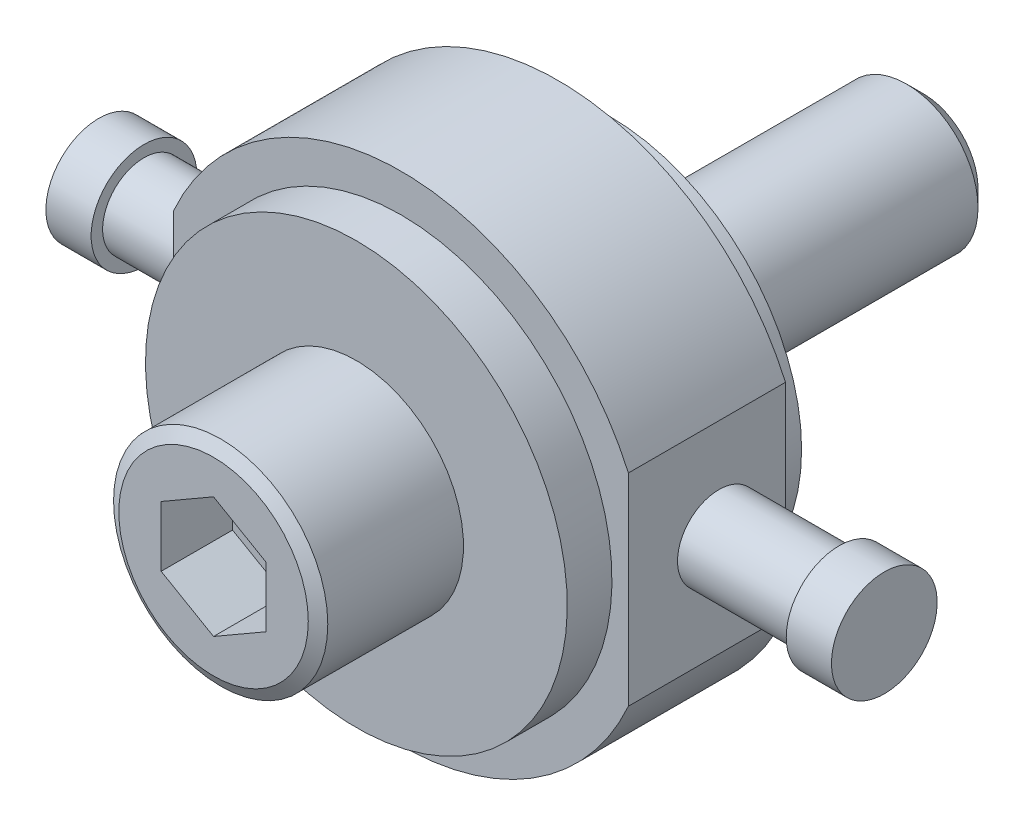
ISO-10303-21;
HEADER;
FILE_DESCRIPTION(('STEP AP214'),'2;1');
FILE_NAME('part.step','',(''),(''),'','','');
FILE_SCHEMA(('AUTOMOTIVE_DESIGN { 1 0 10303 214 1 1 1 1 }'));
ENDSEC;
DATA;
#1=APPLICATION_CONTEXT('core data for automotive mechanical design processes');
#2=APPLICATION_PROTOCOL_DEFINITION('international standard','automotive_design',2000,#1);
#3=PRODUCT_CONTEXT('',#1,'mechanical');
#4=PRODUCT('Part','Part','',(#3));
#5=PRODUCT_RELATED_PRODUCT_CATEGORY('part','',(#4));
#6=PRODUCT_DEFINITION_FORMATION('','',#4);
#7=PRODUCT_DEFINITION_CONTEXT('part definition',#1,'design');
#8=PRODUCT_DEFINITION('design','',#6,#7);
#9=PRODUCT_DEFINITION_SHAPE('','',#8);
#10=(LENGTH_UNIT() NAMED_UNIT(*) SI_UNIT(.MILLI.,.METRE.));
#11=(NAMED_UNIT(*) PLANE_ANGLE_UNIT() SI_UNIT($,.RADIAN.));
#12=(NAMED_UNIT(*) SI_UNIT($,.STERADIAN.) SOLID_ANGLE_UNIT());
#13=UNCERTAINTY_MEASURE_WITH_UNIT(LENGTH_MEASURE(1.E-05),#10,'distance_accuracy_value','');
#14=(GEOMETRIC_REPRESENTATION_CONTEXT(3) GLOBAL_UNCERTAINTY_ASSIGNED_CONTEXT((#13)) GLOBAL_UNIT_ASSIGNED_CONTEXT((#10,
#11,#12)) REPRESENTATION_CONTEXT('',''));
#15=CARTESIAN_POINT('',(0.,0.,0.));
#16=DIRECTION('',(0.,0.,1.));
#17=DIRECTION('',(1.,0.,0.));
#18=AXIS2_PLACEMENT_3D('',#15,#16,#17);
#19=CARTESIAN_POINT('',(15.18,-15.18,-66.));
#20=DIRECTION('',(0.,0.,-1.));
#21=DIRECTION('',(-1.,0.,0.));
#22=AXIS2_PLACEMENT_3D('',#19,#20,#21);
#23=PLANE('',#22);
#24=CARTESIAN_POINT('',(0.,0.,-66.));
#25=DIRECTION('',(0.,0.,-1.));
#26=DIRECTION('',(-1.,0.,0.));
#27=AXIS2_PLACEMENT_3D('',#24,#25,#26);
#28=CIRCLE('',#27,11.5);
#29=CARTESIAN_POINT('',(-11.5,0.,-66.));
#30=VERTEX_POINT('',#29);
#31=EDGE_CURVE('E166',#30,#30,#28,.T.);
#32=ORIENTED_EDGE('',*,*,#31,.T.);
#33=EDGE_LOOP('',(#32));
#34=FACE_BOUND('',#33,.T.);
#35=ADVANCED_FACE('F14',(#34),#23,.T.);
#36=CARTESIAN_POINT('',(-22.77,-22.77,83.07));
#37=DIRECTION('',(0.,0.,1.));
#38=DIRECTION('',(1.,0.,0.));
#39=AXIS2_PLACEMENT_3D('',#36,#37,#38);
#40=PLANE('',#39);
#41=DIRECTION('',(-0.866025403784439,0.5,0.));
#42=VECTOR('',#41,1.);
#43=CARTESIAN_POINT('',(11.,6.35085296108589,83.07));
#44=LINE('',#43,#42);
#45=CARTESIAN_POINT('',(11.,6.35085296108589,83.07));
#46=VERTEX_POINT('',#45);
#47=CARTESIAN_POINT('',(0.,12.7017059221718,83.07));
#48=VERTEX_POINT('',#47);
#49=EDGE_CURVE('E127',#46,#48,#44,.T.);
#50=ORIENTED_EDGE('',*,*,#49,.F.);
#51=DIRECTION('',(0.,1.,0.));
#52=VECTOR('',#51,1.);
#53=CARTESIAN_POINT('',(11.,-6.35085296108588,83.07));
#54=LINE('',#53,#52);
#55=CARTESIAN_POINT('',(11.,-6.35085296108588,83.07));
#56=VERTEX_POINT('',#55);
#57=EDGE_CURVE('E299',#56,#46,#54,.T.);
#58=ORIENTED_EDGE('',*,*,#57,.F.);
#59=DIRECTION('',(0.866025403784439,0.5,0.));
#60=VECTOR('',#59,1.);
#61=CARTESIAN_POINT('',(0.,-12.7017059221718,83.07));
#62=LINE('',#61,#60);
#63=CARTESIAN_POINT('',(0.,-12.7017059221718,83.07));
#64=VERTEX_POINT('',#63);
#65=EDGE_CURVE('E296',#64,#56,#62,.T.);
#66=ORIENTED_EDGE('',*,*,#65,.F.);
#67=DIRECTION('',(0.866025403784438,-0.5,0.));
#68=VECTOR('',#67,1.);
#69=CARTESIAN_POINT('',(-11.,-6.35085296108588,83.07));
#70=LINE('',#69,#68);
#71=CARTESIAN_POINT('',(-11.,-6.35085296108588,83.07));
#72=VERTEX_POINT('',#71);
#73=EDGE_CURVE('E293',#72,#64,#70,.T.);
#74=ORIENTED_EDGE('',*,*,#73,.F.);
#75=DIRECTION('',(0.,-1.,0.));
#76=VECTOR('',#75,1.);
#77=CARTESIAN_POINT('',(-11.,6.35085296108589,83.07));
#78=LINE('',#77,#76);
#79=CARTESIAN_POINT('',(-11.,6.35085296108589,83.07));
#80=VERTEX_POINT('',#79);
#81=EDGE_CURVE('E290',#80,#72,#78,.T.);
#82=ORIENTED_EDGE('',*,*,#81,.F.);
#83=DIRECTION('',(-0.866025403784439,-0.5,0.));
#84=VECTOR('',#83,1.);
#85=CARTESIAN_POINT('',(0.,12.7017059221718,83.07));
#86=LINE('',#85,#84);
#87=EDGE_CURVE('E288',#48,#80,#86,.T.);
#88=ORIENTED_EDGE('',*,*,#87,.F.);
#89=EDGE_LOOP('',(#50,#58,#66,#74,#82,#88));
#90=FACE_BOUND('',#89,.T.);
#91=CARTESIAN_POINT('',(0.,0.,83.07));
#92=DIRECTION('',(0.,0.,1.));
#93=DIRECTION('',(1.,0.,0.));
#94=AXIS2_PLACEMENT_3D('',#91,#92,#93);
#95=CIRCLE('',#94,19.9019237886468);
#96=CARTESIAN_POINT('',(19.9019237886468,0.,83.07));
#97=VERTEX_POINT('',#96);
#98=EDGE_CURVE('E169',#97,#97,#95,.T.);
#99=ORIENTED_EDGE('',*,*,#98,.T.);
#100=EDGE_LOOP('',(#99));
#101=FACE_BOUND('',#100,.T.);
#102=ADVANCED_FACE('F174',(#90,#101),#40,.T.);
#103=CARTESIAN_POINT('',(0.,0.,-66.));
#104=DIRECTION('',(0.,0.,1.));
#105=DIRECTION('',(1.,0.,0.));
#106=AXIS2_PLACEMENT_3D('',#103,#104,#105);
#107=CYLINDRICAL_SURFACE('',#106,15.);
#108=CARTESIAN_POINT('',(0.,0.,-62.5));
#109=DIRECTION('',(0.,0.,-1.));
#110=DIRECTION('',(-1.,0.,0.));
#111=AXIS2_PLACEMENT_3D('',#108,#109,#110);
#112=CIRCLE('',#111,15.);
#113=CARTESIAN_POINT('',(-15.,0.,-62.5));
#114=VERTEX_POINT('',#113);
#115=EDGE_CURVE('E165',#114,#114,#112,.F.);
#116=ORIENTED_EDGE('',*,*,#115,.T.);
#117=EDGE_LOOP('',(#116));
#118=FACE_BOUND('',#117,.T.);
#119=CARTESIAN_POINT('',(0.,0.,0.));
#120=DIRECTION('',(0.,0.,1.));
#121=DIRECTION('',(1.,0.,0.));
#122=AXIS2_PLACEMENT_3D('',#119,#120,#121);
#123=CIRCLE('',#122,15.);
#124=CARTESIAN_POINT('',(15.,0.,0.));
#125=VERTEX_POINT('',#124);
#126=EDGE_CURVE('E162',#125,#125,#123,.F.);
#127=ORIENTED_EDGE('',*,*,#126,.T.);
#128=EDGE_LOOP('',(#127));
#129=FACE_BOUND('',#128,.T.);
#130=ADVANCED_FACE('F240',(#118,#129),#107,.T.);
#131=CARTESIAN_POINT('',(0.,0.,83.07));
#132=DIRECTION('',(0.,0.,-1.));
#133=DIRECTION('',(-1.,0.,0.));
#134=AXIS2_PLACEMENT_3D('',#131,#132,#133);
#135=CYLINDRICAL_SURFACE('',#134,22.5);
#136=CARTESIAN_POINT('',(0.,0.,81.57));
#137=DIRECTION('',(0.,0.,1.));
#138=DIRECTION('',(1.,0.,0.));
#139=AXIS2_PLACEMENT_3D('',#136,#137,#138);
#140=CIRCLE('',#139,22.5);
#141=CARTESIAN_POINT('',(22.5,0.,81.57));
#142=VERTEX_POINT('',#141);
#143=EDGE_CURVE('E18',#142,#142,#140,.F.);
#144=ORIENTED_EDGE('',*,*,#143,.T.);
#145=EDGE_LOOP('',(#144));
#146=FACE_BOUND('',#145,.T.);
#147=CARTESIAN_POINT('',(0.,0.,53.07));
#148=DIRECTION('',(0.,0.,-1.));
#149=DIRECTION('',(-1.,0.,0.));
#150=AXIS2_PLACEMENT_3D('',#147,#148,#149);
#151=CIRCLE('',#150,22.5);
#152=CARTESIAN_POINT('',(-22.5,0.,53.07));
#153=VERTEX_POINT('',#152);
#154=EDGE_CURVE('E156',#153,#153,#151,.T.);
#155=ORIENTED_EDGE('',*,*,#154,.F.);
#156=EDGE_LOOP('',(#155));
#157=FACE_BOUND('',#156,.T.);
#158=ADVANCED_FACE('F246',(#146,#157),#135,.T.);
#159=CARTESIAN_POINT('',(-40.9354,-40.9354,0.));
#160=DIRECTION('',(0.,0.,1.));
#161=DIRECTION('',(1.,0.,0.));
#162=AXIS2_PLACEMENT_3D('',#159,#160,#161);
#163=PLANE('',#162);
#164=ORIENTED_EDGE('',*,*,#126,.F.);
#165=EDGE_LOOP('',(#164));
#166=FACE_BOUND('',#165,.T.);
#167=CARTESIAN_POINT('',(0.,0.,0.));
#168=DIRECTION('',(0.,0.,-1.));
#169=DIRECTION('',(0.,1.,0.));
#170=AXIS2_PLACEMENT_3D('',#167,#168,#169);
#171=CIRCLE('',#170,40.45);
#172=CARTESIAN_POINT('',(0.,40.45,0.));
#173=VERTEX_POINT('',#172);
#174=EDGE_CURVE('E157',#173,#173,#171,.T.);
#175=ORIENTED_EDGE('',*,*,#174,.T.);
#176=EDGE_LOOP('',(#175));
#177=FACE_BOUND('',#176,.T.);
#178=ADVANCED_FACE('F242',(#166,#177),#163,.F.);
#179=CARTESIAN_POINT('',(-44.8316,-44.8316,53.07));
#180=DIRECTION('',(0.,0.,1.));
#181=DIRECTION('',(1.,0.,0.));
#182=AXIS2_PLACEMENT_3D('',#179,#180,#181);
#183=PLANE('',#182);
#184=ORIENTED_EDGE('',*,*,#154,.T.);
#185=EDGE_LOOP('',(#184));
#186=FACE_BOUND('',#185,.T.);
#187=CARTESIAN_POINT('',(0.,0.,53.07));
#188=DIRECTION('',(0.,0.,-1.));
#189=DIRECTION('',(0.,1.,0.));
#190=AXIS2_PLACEMENT_3D('',#187,#188,#189);
#191=CIRCLE('',#190,44.3);
#192=CARTESIAN_POINT('',(0.,44.3,53.07));
#193=VERTEX_POINT('',#192);
#194=EDGE_CURVE('E153',#193,#193,#191,.F.);
#195=ORIENTED_EDGE('',*,*,#194,.T.);
#196=EDGE_LOOP('',(#195));
#197=FACE_BOUND('',#196,.T.);
#198=ADVANCED_FACE('F245',(#186,#197),#183,.T.);
#199=CARTESIAN_POINT('',(0.,0.,10.68));
#200=DIRECTION('',(0.,0.,-1.));
#201=DIRECTION('',(0.,1.,0.));
#202=AXIS2_PLACEMENT_3D('',#199,#200,#201);
#203=CYLINDRICAL_SURFACE('',#202,40.45);
#204=CARTESIAN_POINT('',(0.,0.,10.68));
#205=DIRECTION('',(0.,0.,-1.));
#206=DIRECTION('',(0.,1.,0.));
#207=AXIS2_PLACEMENT_3D('',#204,#205,#206);
#208=CIRCLE('',#207,40.45);
#209=CARTESIAN_POINT('',(0.,40.45,10.68));
#210=VERTEX_POINT('',#209);
#211=EDGE_CURVE('E146',#210,#210,#208,.T.);
#212=ORIENTED_EDGE('',*,*,#211,.T.);
#213=EDGE_LOOP('',(#212));
#214=FACE_BOUND('',#213,.T.);
#215=ORIENTED_EDGE('',*,*,#174,.F.);
#216=EDGE_LOOP('',(#215));
#217=FACE_BOUND('',#216,.T.);
#218=ADVANCED_FACE('F250',(#214,#217),#203,.T.);
#219=CARTESIAN_POINT('',(0.,0.,53.07));
#220=DIRECTION('',(0.,0.,-1.));
#221=DIRECTION('',(0.,1.,0.));
#222=AXIS2_PLACEMENT_3D('',#219,#220,#221);
#223=CYLINDRICAL_SURFACE('',#222,44.3);
#224=CARTESIAN_POINT('',(0.,0.,43.68));
#225=DIRECTION('',(0.,0.,-1.));
#226=DIRECTION('',(0.,1.,0.));
#227=AXIS2_PLACEMENT_3D('',#224,#225,#226);
#228=CIRCLE('',#227,44.3);
#229=CARTESIAN_POINT('',(0.,44.3,43.68));
#230=VERTEX_POINT('',#229);
#231=EDGE_CURVE('E143',#230,#230,#228,.T.);
#232=ORIENTED_EDGE('',*,*,#231,.F.);
#233=EDGE_LOOP('',(#232));
#234=FACE_BOUND('',#233,.T.);
#235=ORIENTED_EDGE('',*,*,#194,.F.);
#236=EDGE_LOOP('',(#235));
#237=FACE_BOUND('',#236,.T.);
#238=ADVANCED_FACE('F254',(#234,#237),#223,.T.);
#239=CARTESIAN_POINT('',(-47.75,-52.877,10.68));
#240=DIRECTION('',(0.,0.,1.));
#241=DIRECTION('',(1.,0.,0.));
#242=AXIS2_PLACEMENT_3D('',#239,#240,#241);
#243=PLANE('',#242);
#244=ORIENTED_EDGE('',*,*,#211,.F.);
#245=EDGE_LOOP('',(#244));
#246=FACE_BOUND('',#245,.T.);
#247=DIRECTION('',(0.,1.,0.));
#248=VECTOR('',#247,1.);
#249=CARTESIAN_POINT('',(47.75,0.,10.68));
#250=LINE('',#249,#248);
#251=CARTESIAN_POINT('',(47.75,-21.2132034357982,10.68));
#252=VERTEX_POINT('',#251);
#253=CARTESIAN_POINT('',(47.75,21.2132034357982,10.68));
#254=VERTEX_POINT('',#253);
#255=EDGE_CURVE('E92',#252,#254,#250,.T.);
#256=ORIENTED_EDGE('',*,*,#255,.F.);
#257=CARTESIAN_POINT('',(0.,0.,10.68));
#258=DIRECTION('',(0.,0.,-1.));
#259=DIRECTION('',(0.,1.,0.));
#260=AXIS2_PLACEMENT_3D('',#257,#258,#259);
#261=CIRCLE('',#260,52.25);
#262=CARTESIAN_POINT('',(-47.75,-21.2132034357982,10.68));
#263=VERTEX_POINT('',#262);
#264=EDGE_CURVE('E144',#252,#263,#261,.T.);
#265=ORIENTED_EDGE('',*,*,#264,.T.);
#266=DIRECTION('',(0.,1.,0.));
#267=VECTOR('',#266,1.);
#268=CARTESIAN_POINT('',(-47.75,0.,10.68));
#269=LINE('',#268,#267);
#270=CARTESIAN_POINT('',(-47.75,21.2132034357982,10.68));
#271=VERTEX_POINT('',#270);
#272=EDGE_CURVE('E95',#263,#271,#269,.T.);
#273=ORIENTED_EDGE('',*,*,#272,.T.);
#274=CARTESIAN_POINT('',(0.,0.,10.68));
#275=DIRECTION('',(0.,0.,-1.));
#276=DIRECTION('',(0.,1.,0.));
#277=AXIS2_PLACEMENT_3D('',#274,#275,#276);
#278=CIRCLE('',#277,52.25);
#279=EDGE_CURVE('E88',#271,#254,#278,.T.);
#280=ORIENTED_EDGE('',*,*,#279,.T.);
#281=EDGE_LOOP('',(#256,#265,#273,#280));
#282=FACE_BOUND('',#281,.T.);
#283=ADVANCED_FACE('F90',(#246,#282),#243,.F.);
#284=CARTESIAN_POINT('',(0.,0.,43.68));
#285=DIRECTION('',(0.,0.,-1.));
#286=DIRECTION('',(0.,1.,0.));
#287=AXIS2_PLACEMENT_3D('',#284,#285,#286);
#288=CYLINDRICAL_SURFACE('',#287,52.25);
#289=CARTESIAN_POINT('',(0.,0.,43.68));
#290=DIRECTION('',(0.,0.,-1.));
#291=DIRECTION('',(0.,1.,0.));
#292=AXIS2_PLACEMENT_3D('',#289,#290,#291);
#293=CIRCLE('',#292,52.25);
#294=CARTESIAN_POINT('',(47.75,21.2132034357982,43.68));
#295=VERTEX_POINT('',#294);
#296=CARTESIAN_POINT('',(-47.75,21.2132034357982,43.68));
#297=VERTEX_POINT('',#296);
#298=EDGE_CURVE('E104',#295,#297,#293,.F.);
#299=ORIENTED_EDGE('',*,*,#298,.F.);
#300=DIRECTION('',(0.,0.,1.));
#301=VECTOR('',#300,1.);
#302=CARTESIAN_POINT('',(47.75,21.213203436,27.18));
#303=LINE('',#302,#301);
#304=EDGE_CURVE('E101',#254,#295,#303,.T.);
#305=ORIENTED_EDGE('',*,*,#304,.F.);
#306=ORIENTED_EDGE('',*,*,#279,.F.);
#307=DIRECTION('',(0.,0.,1.));
#308=VECTOR('',#307,1.);
#309=CARTESIAN_POINT('',(-47.75,21.213203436,27.18));
#310=LINE('',#309,#308);
#311=EDGE_CURVE('E98',#271,#297,#310,.T.);
#312=ORIENTED_EDGE('',*,*,#311,.T.);
#313=EDGE_LOOP('',(#299,#305,#306,#312));
#314=FACE_BOUND('',#313,.T.);
#315=ADVANCED_FACE('F102',(#314),#288,.T.);
#316=CARTESIAN_POINT('',(-47.75,-52.877,43.68));
#317=DIRECTION('',(0.,0.,1.));
#318=DIRECTION('',(1.,0.,0.));
#319=AXIS2_PLACEMENT_3D('',#316,#317,#318);
#320=PLANE('',#319);
#321=ORIENTED_EDGE('',*,*,#231,.T.);
#322=EDGE_LOOP('',(#321));
#323=FACE_BOUND('',#322,.T.);
#324=CARTESIAN_POINT('',(0.,0.,43.68));
#325=DIRECTION('',(0.,0.,-1.));
#326=DIRECTION('',(0.,1.,0.));
#327=AXIS2_PLACEMENT_3D('',#324,#325,#326);
#328=CIRCLE('',#327,52.25);
#329=CARTESIAN_POINT('',(-47.75,-21.2132034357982,43.68));
#330=VERTEX_POINT('',#329);
#331=CARTESIAN_POINT('',(47.75,-21.2132034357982,43.68));
#332=VERTEX_POINT('',#331);
#333=EDGE_CURVE('E141',#330,#332,#328,.F.);
#334=ORIENTED_EDGE('',*,*,#333,.T.);
#335=DIRECTION('',(0.,-1.,0.));
#336=VECTOR('',#335,1.);
#337=CARTESIAN_POINT('',(47.75,0.,43.68));
#338=LINE('',#337,#336);
#339=EDGE_CURVE('E108',#295,#332,#338,.T.);
#340=ORIENTED_EDGE('',*,*,#339,.F.);
#341=ORIENTED_EDGE('',*,*,#298,.T.);
#342=DIRECTION('',(0.,-1.,0.));
#343=VECTOR('',#342,1.);
#344=CARTESIAN_POINT('',(-47.75,0.,43.68));
#345=LINE('',#344,#343);
#346=EDGE_CURVE('E149',#297,#330,#345,.T.);
#347=ORIENTED_EDGE('',*,*,#346,.T.);
#348=EDGE_LOOP('',(#334,#340,#341,#347));
#349=FACE_BOUND('',#348,.T.);
#350=ADVANCED_FACE('F256',(#323,#349),#320,.T.);
#351=CARTESIAN_POINT('',(0.,0.,43.68));
#352=DIRECTION('',(0.,0.,-1.));
#353=DIRECTION('',(0.,1.,0.));
#354=AXIS2_PLACEMENT_3D('',#351,#352,#353);
#355=CYLINDRICAL_SURFACE('',#354,52.25);
#356=ORIENTED_EDGE('',*,*,#333,.F.);
#357=DIRECTION('',(0.,0.,-1.));
#358=VECTOR('',#357,1.);
#359=CARTESIAN_POINT('',(-47.75,-21.213203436,27.18));
#360=LINE('',#359,#358);
#361=EDGE_CURVE('E116',#330,#263,#360,.T.);
#362=ORIENTED_EDGE('',*,*,#361,.T.);
#363=ORIENTED_EDGE('',*,*,#264,.F.);
#364=DIRECTION('',(0.,0.,-1.));
#365=VECTOR('',#364,1.);
#366=CARTESIAN_POINT('',(47.75,-21.213203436,27.18));
#367=LINE('',#366,#365);
#368=EDGE_CURVE('E112',#332,#252,#367,.T.);
#369=ORIENTED_EDGE('',*,*,#368,.F.);
#370=EDGE_LOOP('',(#356,#362,#363,#369));
#371=FACE_BOUND('',#370,.T.);
#372=ADVANCED_FACE('F259',(#371),#355,.T.);
#373=CARTESIAN_POINT('',(47.75,-21.213203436,43.68));
#374=DIRECTION('',(1.,0.,0.));
#375=DIRECTION('',(0.,0.,-1.));
#376=AXIS2_PLACEMENT_3D('',#373,#374,#375);
#377=PLANE('',#376);
#378=CARTESIAN_POINT('',(47.75,0.,24.68));
#379=DIRECTION('',(-1.,0.,0.));
#380=DIRECTION('',(0.,0.,1.));
#381=AXIS2_PLACEMENT_3D('',#378,#379,#380);
#382=CIRCLE('',#381,8.685);
#383=CARTESIAN_POINT('',(47.75,0.,33.365));
#384=VERTEX_POINT('',#383);
#385=EDGE_CURVE('E113',#384,#384,#382,.T.);
#386=ORIENTED_EDGE('',*,*,#385,.T.);
#387=EDGE_LOOP('',(#386));
#388=FACE_BOUND('',#387,.T.);
#389=ORIENTED_EDGE('',*,*,#255,.T.);
#390=ORIENTED_EDGE('',*,*,#304,.T.);
#391=ORIENTED_EDGE('',*,*,#339,.T.);
#392=ORIENTED_EDGE('',*,*,#368,.T.);
#393=EDGE_LOOP('',(#389,#390,#391,#392));
#394=FACE_BOUND('',#393,.T.);
#395=ADVANCED_FACE('F110',(#388,#394),#377,.T.);
#396=CARTESIAN_POINT('',(-47.75,-21.213203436,43.68));
#397=DIRECTION('',(1.,0.,0.));
#398=DIRECTION('',(0.,0.,-1.));
#399=AXIS2_PLACEMENT_3D('',#396,#397,#398);
#400=PLANE('',#399);
#401=CARTESIAN_POINT('',(-47.75,0.,24.68));
#402=DIRECTION('',(1.,0.,0.));
#403=DIRECTION('',(0.,0.,-1.));
#404=AXIS2_PLACEMENT_3D('',#401,#402,#403);
#405=CIRCLE('',#404,8.685);
#406=CARTESIAN_POINT('',(-47.75,0.,15.995));
#407=VERTEX_POINT('',#406);
#408=EDGE_CURVE('E136',#407,#407,#405,.T.);
#409=ORIENTED_EDGE('',*,*,#408,.T.);
#410=EDGE_LOOP('',(#409));
#411=FACE_BOUND('',#410,.T.);
#412=ORIENTED_EDGE('',*,*,#346,.F.);
#413=ORIENTED_EDGE('',*,*,#311,.F.);
#414=ORIENTED_EDGE('',*,*,#272,.F.);
#415=ORIENTED_EDGE('',*,*,#361,.F.);
#416=EDGE_LOOP('',(#412,#413,#414,#415));
#417=FACE_BOUND('',#416,.T.);
#418=ADVANCED_FACE('F263',(#411,#417),#400,.F.);
#419=CARTESIAN_POINT('',(73.,0.,24.68));
#420=DIRECTION('',(-1.,0.,0.));
#421=DIRECTION('',(0.,0.,1.));
#422=AXIS2_PLACEMENT_3D('',#419,#420,#421);
#423=CYLINDRICAL_SURFACE('',#422,8.685);
#424=CARTESIAN_POINT('',(73.,0.,24.68));
#425=DIRECTION('',(-1.,0.,0.));
#426=DIRECTION('',(0.,0.,1.));
#427=AXIS2_PLACEMENT_3D('',#424,#425,#426);
#428=CIRCLE('',#427,8.685);
#429=CARTESIAN_POINT('',(73.,0.,33.365));
#430=VERTEX_POINT('',#429);
#431=EDGE_CURVE('E128',#430,#430,#428,.F.);
#432=ORIENTED_EDGE('',*,*,#431,.F.);
#433=EDGE_LOOP('',(#432));
#434=FACE_BOUND('',#433,.T.);
#435=ORIENTED_EDGE('',*,*,#385,.F.);
#436=EDGE_LOOP('',(#435));
#437=FACE_BOUND('',#436,.T.);
#438=ADVANCED_FACE('F266',(#434,#437),#423,.T.);
#439=CARTESIAN_POINT('',(-73.,0.,24.68));
#440=DIRECTION('',(1.,0.,0.));
#441=DIRECTION('',(0.,0.,-1.));
#442=AXIS2_PLACEMENT_3D('',#439,#440,#441);
#443=CYLINDRICAL_SURFACE('',#442,8.685);
#444=ORIENTED_EDGE('',*,*,#408,.F.);
#445=EDGE_LOOP('',(#444));
#446=FACE_BOUND('',#445,.T.);
#447=CARTESIAN_POINT('',(-73.,0.,24.68));
#448=DIRECTION('',(1.,0.,0.));
#449=DIRECTION('',(0.,0.,-1.));
#450=AXIS2_PLACEMENT_3D('',#447,#448,#449);
#451=CIRCLE('',#450,8.685);
#452=CARTESIAN_POINT('',(-73.,0.,15.995));
#453=VERTEX_POINT('',#452);
#454=EDGE_CURVE('E133',#453,#453,#451,.T.);
#455=ORIENTED_EDGE('',*,*,#454,.T.);
#456=EDGE_LOOP('',(#455));
#457=FACE_BOUND('',#456,.T.);
#458=ADVANCED_FACE('F200',(#446,#457),#443,.T.);
#459=CARTESIAN_POINT('',(73.,9.0068,15.6732));
#460=DIRECTION('',(-1.,0.,0.));
#461=DIRECTION('',(0.,-1.,0.));
#462=AXIS2_PLACEMENT_3D('',#459,#460,#461);
#463=PLANE('',#462);
#464=ORIENTED_EDGE('',*,*,#431,.T.);
#465=EDGE_LOOP('',(#464));
#466=FACE_BOUND('',#465,.T.);
#467=CARTESIAN_POINT('',(73.,0.,24.68));
#468=DIRECTION('',(-1.,0.,0.));
#469=DIRECTION('',(0.,0.,1.));
#470=AXIS2_PLACEMENT_3D('',#467,#468,#469);
#471=CIRCLE('',#470,11.1);
#472=CARTESIAN_POINT('',(73.,0.,35.78));
#473=VERTEX_POINT('',#472);
#474=EDGE_CURVE('E125',#473,#473,#471,.T.);
#475=ORIENTED_EDGE('',*,*,#474,.T.);
#476=EDGE_LOOP('',(#475));
#477=FACE_BOUND('',#476,.T.);
#478=ADVANCED_FACE('F193',(#466,#477),#463,.T.);
#479=CARTESIAN_POINT('',(-73.,9.0068,15.6732));
#480=DIRECTION('',(-1.,0.,0.));
#481=DIRECTION('',(0.,-1.,0.));
#482=AXIS2_PLACEMENT_3D('',#479,#480,#481);
#483=PLANE('',#482);
#484=ORIENTED_EDGE('',*,*,#454,.F.);
#485=EDGE_LOOP('',(#484));
#486=FACE_BOUND('',#485,.T.);
#487=CARTESIAN_POINT('',(-73.,0.,24.68));
#488=DIRECTION('',(1.,0.,0.));
#489=DIRECTION('',(0.,0.,-1.));
#490=AXIS2_PLACEMENT_3D('',#487,#488,#489);
#491=CIRCLE('',#490,11.1);
#492=CARTESIAN_POINT('',(-73.,0.,13.58));
#493=VERTEX_POINT('',#492);
#494=EDGE_CURVE('E24',#493,#493,#491,.T.);
#495=ORIENTED_EDGE('',*,*,#494,.T.);
#496=EDGE_LOOP('',(#495));
#497=FACE_BOUND('',#496,.T.);
#498=ADVANCED_FACE('F189',(#486,#497),#483,.F.);
#499=CARTESIAN_POINT('',(0.,0.,-66.));
#500=DIRECTION('',(0.,0.,1.));
#501=DIRECTION('',(1.,0.,0.));
#502=AXIS2_PLACEMENT_3D('',#499,#500,#501);
#503=CONICAL_SURFACE('',#502,11.5,0.785398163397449);
#504=ORIENTED_EDGE('',*,*,#115,.F.);
#505=EDGE_LOOP('',(#504));
#506=FACE_BOUND('',#505,.T.);
#507=ORIENTED_EDGE('',*,*,#31,.F.);
#508=EDGE_LOOP('',(#507));
#509=FACE_BOUND('',#508,.T.);
#510=ADVANCED_FACE('F178',(#506,#509),#503,.T.);
#511=CARTESIAN_POINT('',(0.,0.,83.07));
#512=DIRECTION('',(0.,0.,-1.));
#513=DIRECTION('',(-1.,0.,0.));
#514=AXIS2_PLACEMENT_3D('',#511,#512,#513);
#515=CONICAL_SURFACE('',#514,19.9019237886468,1.0471975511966);
#516=ORIENTED_EDGE('',*,*,#143,.F.);
#517=EDGE_LOOP('',(#516));
#518=FACE_BOUND('',#517,.T.);
#519=ORIENTED_EDGE('',*,*,#98,.F.);
#520=EDGE_LOOP('',(#519));
#521=FACE_BOUND('',#520,.T.);
#522=ADVANCED_FACE('F16',(#518,#521),#515,.T.);
#523=CARTESIAN_POINT('',(11.,6.35085296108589,68.07));
#524=DIRECTION('',(0.5,0.866025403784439,0.));
#525=DIRECTION('',(-0.866025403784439,0.5,0.));
#526=AXIS2_PLACEMENT_3D('',#523,#524,#525);
#527=PLANE('',#526);
#528=ORIENTED_EDGE('',*,*,#49,.T.);
#529=DIRECTION('',(0.,0.,1.));
#530=VECTOR('',#529,1.);
#531=CARTESIAN_POINT('',(0.,12.7017059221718,68.07));
#532=LINE('',#531,#530);
#533=CARTESIAN_POINT('',(0.,12.7017059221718,68.07));
#534=VERTEX_POINT('',#533);
#535=EDGE_CURVE('E284',#534,#48,#532,.T.);
#536=ORIENTED_EDGE('',*,*,#535,.F.);
#537=DIRECTION('',(-0.866025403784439,0.5,0.));
#538=VECTOR('',#537,1.);
#539=CARTESIAN_POINT('',(11.,6.35085296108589,68.07));
#540=LINE('',#539,#538);
#541=CARTESIAN_POINT('',(11.,6.35085296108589,68.07));
#542=VERTEX_POINT('',#541);
#543=EDGE_CURVE('E287',#542,#534,#540,.T.);
#544=ORIENTED_EDGE('',*,*,#543,.F.);
#545=DIRECTION('',(0.,0.,1.));
#546=VECTOR('',#545,1.);
#547=CARTESIAN_POINT('',(11.,6.35085296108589,68.07));
#548=LINE('',#547,#546);
#549=EDGE_CURVE('E300',#542,#46,#548,.T.);
#550=ORIENTED_EDGE('',*,*,#549,.T.);
#551=EDGE_LOOP('',(#528,#536,#544,#550));
#552=FACE_BOUND('',#551,.T.);
#553=ADVANCED_FACE('F177',(#552),#527,.F.);
#554=CARTESIAN_POINT('',(11.,-6.35085296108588,68.07));
#555=DIRECTION('',(1.,0.,0.));
#556=DIRECTION('',(0.,0.,-1.));
#557=AXIS2_PLACEMENT_3D('',#554,#555,#556);
#558=PLANE('',#557);
#559=ORIENTED_EDGE('',*,*,#57,.T.);
#560=ORIENTED_EDGE('',*,*,#549,.F.);
#561=DIRECTION('',(0.,1.,0.));
#562=VECTOR('',#561,1.);
#563=CARTESIAN_POINT('',(11.,-6.35085296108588,68.07));
#564=LINE('',#563,#562);
#565=CARTESIAN_POINT('',(11.,-6.35085296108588,68.07));
#566=VERTEX_POINT('',#565);
#567=EDGE_CURVE('E132',#566,#542,#564,.T.);
#568=ORIENTED_EDGE('',*,*,#567,.F.);
#569=DIRECTION('',(0.,0.,1.));
#570=VECTOR('',#569,1.);
#571=CARTESIAN_POINT('',(11.,-6.35085296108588,68.07));
#572=LINE('',#571,#570);
#573=EDGE_CURVE('E297',#566,#56,#572,.T.);
#574=ORIENTED_EDGE('',*,*,#573,.T.);
#575=EDGE_LOOP('',(#559,#560,#568,#574));
#576=FACE_BOUND('',#575,.T.);
#577=ADVANCED_FACE('F186',(#576),#558,.F.);
#578=CARTESIAN_POINT('',(0.,-12.7017059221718,68.07));
#579=DIRECTION('',(0.5,-0.866025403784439,0.));
#580=DIRECTION('',(0.866025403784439,0.5,0.));
#581=AXIS2_PLACEMENT_3D('',#578,#579,#580);
#582=PLANE('',#581);
#583=ORIENTED_EDGE('',*,*,#65,.T.);
#584=ORIENTED_EDGE('',*,*,#573,.F.);
#585=DIRECTION('',(0.866025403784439,0.5,0.));
#586=VECTOR('',#585,1.);
#587=CARTESIAN_POINT('',(0.,-12.7017059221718,68.07));
#588=LINE('',#587,#586);
#589=CARTESIAN_POINT('',(0.,-12.7017059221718,68.07));
#590=VERTEX_POINT('',#589);
#591=EDGE_CURVE('E315',#590,#566,#588,.T.);
#592=ORIENTED_EDGE('',*,*,#591,.F.);
#593=DIRECTION('',(0.,0.,1.));
#594=VECTOR('',#593,1.);
#595=CARTESIAN_POINT('',(0.,-12.7017059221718,68.07));
#596=LINE('',#595,#594);
#597=EDGE_CURVE('E294',#590,#64,#596,.T.);
#598=ORIENTED_EDGE('',*,*,#597,.T.);
#599=EDGE_LOOP('',(#583,#584,#592,#598));
#600=FACE_BOUND('',#599,.T.);
#601=ADVANCED_FACE('F526',(#600),#582,.F.);
#602=CARTESIAN_POINT('',(-11.,-6.35085296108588,68.07));
#603=DIRECTION('',(-0.5,-0.866025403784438,0.));
#604=DIRECTION('',(0.866025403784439,-0.5,0.));
#605=AXIS2_PLACEMENT_3D('',#602,#603,#604);
#606=PLANE('',#605);
#607=ORIENTED_EDGE('',*,*,#73,.T.);
#608=ORIENTED_EDGE('',*,*,#597,.F.);
#609=DIRECTION('',(0.866025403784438,-0.5,0.));
#610=VECTOR('',#609,1.);
#611=CARTESIAN_POINT('',(-11.,-6.35085296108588,68.07));
#612=LINE('',#611,#610);
#613=CARTESIAN_POINT('',(-11.,-6.35085296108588,68.07));
#614=VERTEX_POINT('',#613);
#615=EDGE_CURVE('E318',#614,#590,#612,.T.);
#616=ORIENTED_EDGE('',*,*,#615,.F.);
#617=DIRECTION('',(0.,0.,1.));
#618=VECTOR('',#617,1.);
#619=CARTESIAN_POINT('',(-11.,-6.35085296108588,68.07));
#620=LINE('',#619,#618);
#621=EDGE_CURVE('E291',#614,#72,#620,.T.);
#622=ORIENTED_EDGE('',*,*,#621,.T.);
#623=EDGE_LOOP('',(#607,#608,#616,#622));
#624=FACE_BOUND('',#623,.T.);
#625=ADVANCED_FACE('F345',(#624),#606,.F.);
#626=CARTESIAN_POINT('',(-11.,6.35085296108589,68.07));
#627=DIRECTION('',(-1.,0.,0.));
#628=DIRECTION('',(0.,-1.,0.));
#629=AXIS2_PLACEMENT_3D('',#626,#627,#628);
#630=PLANE('',#629);
#631=ORIENTED_EDGE('',*,*,#81,.T.);
#632=ORIENTED_EDGE('',*,*,#621,.F.);
#633=DIRECTION('',(0.,-1.,0.));
#634=VECTOR('',#633,1.);
#635=CARTESIAN_POINT('',(-11.,6.35085296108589,68.07));
#636=LINE('',#635,#634);
#637=CARTESIAN_POINT('',(-11.,6.35085296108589,68.07));
#638=VERTEX_POINT('',#637);
#639=EDGE_CURVE('E321',#638,#614,#636,.T.);
#640=ORIENTED_EDGE('',*,*,#639,.F.);
#641=DIRECTION('',(0.,0.,1.));
#642=VECTOR('',#641,1.);
#643=CARTESIAN_POINT('',(-11.,6.35085296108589,68.07));
#644=LINE('',#643,#642);
#645=EDGE_CURVE('E33',#638,#80,#644,.T.);
#646=ORIENTED_EDGE('',*,*,#645,.T.);
#647=EDGE_LOOP('',(#631,#632,#640,#646));
#648=FACE_BOUND('',#647,.T.);
#649=ADVANCED_FACE('F337',(#648),#630,.F.);
#650=CARTESIAN_POINT('',(0.,12.7017059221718,68.07));
#651=DIRECTION('',(-0.5,0.866025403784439,0.));
#652=DIRECTION('',(-0.866025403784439,-0.5,0.));
#653=AXIS2_PLACEMENT_3D('',#650,#651,#652);
#654=PLANE('',#653);
#655=ORIENTED_EDGE('',*,*,#87,.T.);
#656=ORIENTED_EDGE('',*,*,#645,.F.);
#657=DIRECTION('',(-0.866025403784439,-0.5,0.));
#658=VECTOR('',#657,1.);
#659=CARTESIAN_POINT('',(0.,12.7017059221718,68.07));
#660=LINE('',#659,#658);
#661=EDGE_CURVE('E324',#534,#638,#660,.T.);
#662=ORIENTED_EDGE('',*,*,#661,.F.);
#663=ORIENTED_EDGE('',*,*,#535,.T.);
#664=EDGE_LOOP('',(#655,#656,#662,#663));
#665=FACE_BOUND('',#664,.T.);
#666=ADVANCED_FACE('F334',(#665),#654,.F.);
#667=CARTESIAN_POINT('',(0.,12.7017059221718,68.07));
#668=DIRECTION('',(0.,0.,1.));
#669=DIRECTION('',(1.,0.,0.));
#670=AXIS2_PLACEMENT_3D('',#667,#668,#669);
#671=PLANE('',#670);
#672=ORIENTED_EDGE('',*,*,#543,.T.);
#673=ORIENTED_EDGE('',*,*,#661,.T.);
#674=ORIENTED_EDGE('',*,*,#639,.T.);
#675=ORIENTED_EDGE('',*,*,#615,.T.);
#676=ORIENTED_EDGE('',*,*,#591,.T.);
#677=ORIENTED_EDGE('',*,*,#567,.T.);
#678=EDGE_LOOP('',(#672,#673,#674,#675,#676,#677));
#679=FACE_BOUND('',#678,.T.);
#680=ADVANCED_FACE('F228',(#679),#671,.T.);
#681=CARTESIAN_POINT('',(82.5,11.2332,13.4468));
#682=DIRECTION('',(-1.,0.,0.));
#683=DIRECTION('',(0.,-1.,0.));
#684=AXIS2_PLACEMENT_3D('',#681,#682,#683);
#685=PLANE('',#684);
#686=CARTESIAN_POINT('',(82.5,0.,24.68));
#687=DIRECTION('',(-1.,0.,0.));
#688=DIRECTION('',(0.,0.,1.));
#689=AXIS2_PLACEMENT_3D('',#686,#687,#688);
#690=CIRCLE('',#689,11.1);
#691=CARTESIAN_POINT('',(82.5,0.,35.78));
#692=VERTEX_POINT('',#691);
#693=EDGE_CURVE('E124',#692,#692,#690,.F.);
#694=ORIENTED_EDGE('',*,*,#693,.T.);
#695=EDGE_LOOP('',(#694));
#696=FACE_BOUND('',#695,.T.);
#697=ADVANCED_FACE('F219',(#696),#685,.F.);
#698=CARTESIAN_POINT('',(82.5,0.,24.68));
#699=DIRECTION('',(-1.,0.,0.));
#700=DIRECTION('',(0.,0.,1.));
#701=AXIS2_PLACEMENT_3D('',#698,#699,#700);
#702=CYLINDRICAL_SURFACE('',#701,11.1);
#703=ORIENTED_EDGE('',*,*,#693,.F.);
#704=EDGE_LOOP('',(#703));
#705=FACE_BOUND('',#704,.T.);
#706=ORIENTED_EDGE('',*,*,#474,.F.);
#707=EDGE_LOOP('',(#706));
#708=FACE_BOUND('',#707,.T.);
#709=ADVANCED_FACE('F210',(#705,#708),#702,.T.);
#710=CARTESIAN_POINT('',(-82.5,11.2332,13.4468));
#711=DIRECTION('',(-1.,0.,0.));
#712=DIRECTION('',(0.,-1.,0.));
#713=AXIS2_PLACEMENT_3D('',#710,#711,#712);
#714=PLANE('',#713);
#715=CARTESIAN_POINT('',(-82.5,0.,24.68));
#716=DIRECTION('',(1.,0.,0.));
#717=DIRECTION('',(0.,0.,-1.));
#718=AXIS2_PLACEMENT_3D('',#715,#716,#717);
#719=CIRCLE('',#718,11.1);
#720=CARTESIAN_POINT('',(-82.5,0.,13.58));
#721=VERTEX_POINT('',#720);
#722=EDGE_CURVE('E9',#721,#721,#719,.F.);
#723=ORIENTED_EDGE('',*,*,#722,.T.);
#724=EDGE_LOOP('',(#723));
#725=FACE_BOUND('',#724,.T.);
#726=ADVANCED_FACE('F207',(#725),#714,.T.);
#727=CARTESIAN_POINT('',(-82.5,0.,24.68));
#728=DIRECTION('',(1.,0.,0.));
#729=DIRECTION('',(0.,0.,-1.));
#730=AXIS2_PLACEMENT_3D('',#727,#728,#729);
#731=CYLINDRICAL_SURFACE('',#730,11.1);
#732=ORIENTED_EDGE('',*,*,#494,.F.);
#733=EDGE_LOOP('',(#732));
#734=FACE_BOUND('',#733,.T.);
#735=ORIENTED_EDGE('',*,*,#722,.F.);
#736=EDGE_LOOP('',(#735));
#737=FACE_BOUND('',#736,.T.);
#738=ADVANCED_FACE('F209',(#734,#737),#731,.T.);
#739=CLOSED_SHELL('',(#35,#102,#130,#158,#178,#198,#218,#238,#283,#315,#350,#372,#395,#418,#438,
#458,#478,#498,#510,#522,#553,#577,#601,#625,#649,#666,#680,#697,#709,#726,#738));
#740=MANIFOLD_SOLID_BREP('B1',#739);
#741=ADVANCED_BREP_SHAPE_REPRESENTATION('',(#18,#740),#14);
#742=SHAPE_DEFINITION_REPRESENTATION(#9,#741);
ENDSEC;
END-ISO-10303-21;
